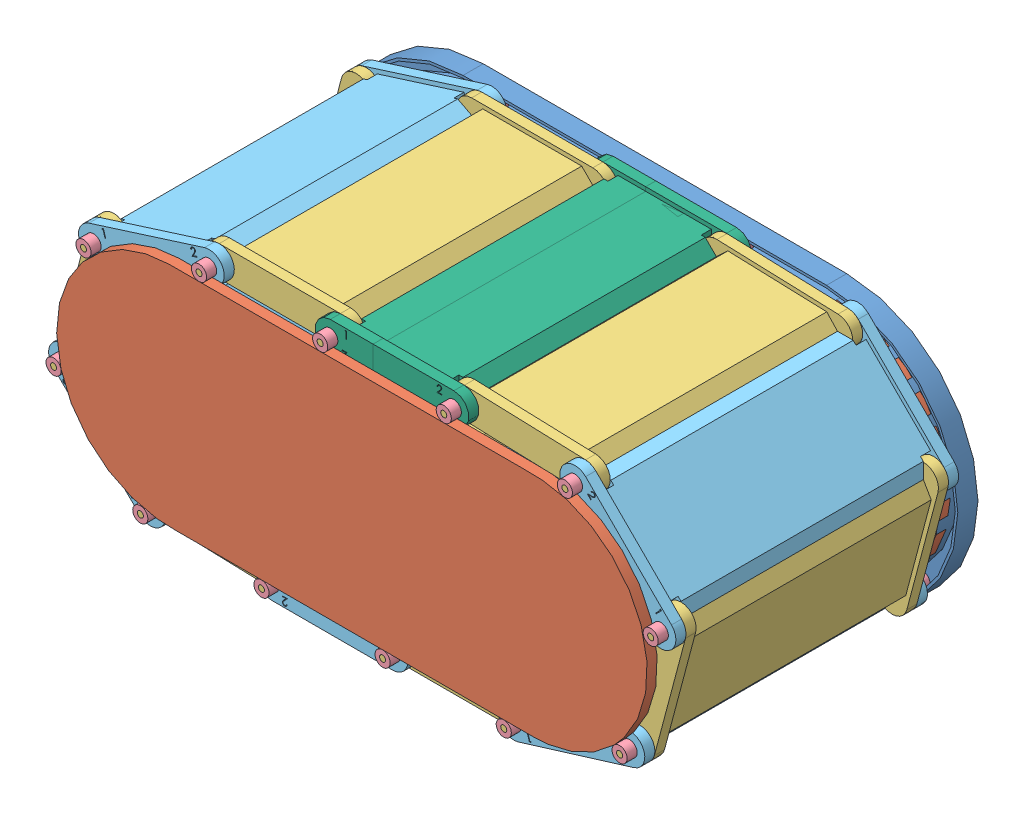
SolidWorks assembly Conveyor_Belt.SLDASM, configuration Default (file format 11000). Lengths in mm.
Overall size (1024.85 352.52 381).
46 component instances, 6 part files, 43 mates.
Components (placement in the parent):
- guide_rail-1: guide_rail.SLDPRT [Default] at (-298.8893 -6.5896 -12.7) size (787.4 330.2 25.4) (hidden)
- conveyor_path-1: conveyor_path.SLDPRT [Surface_Surface_Contact] at (-298.8893 -6.5896 12.7) size (1024.85 285.75 12.7)
- conveyor_path-2: conveyor_path.SLDPRT [Surface_Surface_Contact] at (158.3107 -6.5896 368.3) x (-1 0 0) z (0 0 -1) size (1024.85 285.75 12.7)
- plate-1: plate.sldasm [Default] at (-212.9802 428.2088 190.5) x (-0.999436 0.033586 0) z (0 0 1) size (190.5 38.1 381)
  - plate2-1: plate2.SLDPRT [Default] at (-343.681 273.5692 152.4) size (190.5 38.1 381)
  - wheel-1: wheel.SLDPRT [Default] at (-419.881 273.5692 190.5) size (19.05 19.05 12.7)
  - wheel-2: wheel.SLDPRT [Default] at (-267.481 273.5692 190.5) size (19.05 19.05 12.7)
  - wheel-3: wheel.SLDPRT [Default] at (-419.881 273.5692 -177.8) size (19.05 19.05 12.7)
  - wheel-4: wheel.SLDPRT [Default] at (-267.481 273.5692 -177.8) size (19.05 19.05 12.7)
- plate1-1: plate1.SLDPRT [Default] at (251.4594 86.9125 355.6) x (-0.708444 0.705767 0) z (0 0 1) size (190.5 38.1 355.6)
- plate-2: plate.sldasm [Default] at (638.5638 221.3261 190.5) x (0.25699 0.966414 0) z (0 0 1) size (190.5 38.1 381)
  - plate2-1: plate2.SLDPRT [Default] at (-343.681 273.5692 152.4) size (190.5 38.1 381)
  - wheel-1: wheel.SLDPRT [Default] at (-419.881 273.5692 190.5) size (19.05 19.05 12.7)
  - wheel-2: wheel.SLDPRT [Default] at (-267.481 273.5692 190.5) size (19.05 19.05 12.7)
  - wheel-3: wheel.SLDPRT [Default] at (-419.881 273.5692 -177.8) size (19.05 19.05 12.7)
  - wheel-4: wheel.SLDPRT [Default] at (-267.481 273.5692 -177.8) size (19.05 19.05 12.7)
- plate1-2: plate1.SLDPRT [Default] at (193.4507 -136.569 355.6) x (0.955734 0.294233 0) z (0 0 1) size (190.5 38.1 355.6)
- plate-3: plate.sldasm [Default] at (388.1048 -432.5588 190.5) size (190.5 38.1 381)
  - plate2-1: plate2.SLDPRT [Default] at (-343.681 273.5692 152.4) size (190.5 38.1 381)
  - wheel-1: wheel.SLDPRT [Default] at (-419.881 273.5692 190.5) size (19.05 19.05 12.7)
  - wheel-2: wheel.SLDPRT [Default] at (-267.481 273.5692 190.5) size (19.05 19.05 12.7)
  - wheel-3: wheel.SLDPRT [Default] at (-419.881 273.5692 -177.8) size (19.05 19.05 12.7)
  - wheel-4: wheel.SLDPRT [Default] at (-267.481 273.5692 -177.8) size (19.05 19.05 12.7)
- plate1-3: plate1.SLDPRT [Default] at (-107.9762 -158.9896 355.6) x (-1 0 0) z (0 0 1) size (190.5 38.1 355.6)
- plate-4: plate.sldasm [Default] at (-595.393 127.4382 190.5) x (-0.999521 0.030936 0) z (0 0 1) size (190.5 38.1 381)
  - plate2-1: plate2.SLDPRT [Default] at (-343.681 273.5692 152.4) size (190.5 38.1 381)
  - wheel-1: wheel.SLDPRT [Default] at (-419.881 273.5692 190.5) size (19.05 19.05 12.7)
  - wheel-2: wheel.SLDPRT [Default] at (-267.481 273.5692 190.5) size (19.05 19.05 12.7)
  - wheel-3: wheel.SLDPRT [Default] at (-419.881 273.5692 -177.8) size (19.05 19.05 12.7)
  - wheel-4: wheel.SLDPRT [Default] at (-267.481 273.5692 -177.8) size (19.05 19.05 12.7)
- plate1-4: plate1.SLDPRT [Default] at (-391.0494 -101.0663 355.6) x (-0.715829 0.698276 0) z (0 0 1) size (190.5 38.1 355.6)
- plate-5: plate.sldasm [Default] at (-76.8585 291.514 190.5) x (0.246811 0.969064 0) z (0 0 1) size (190.5 38.1 381)
  - plate2-1: plate2.SLDPRT [Default] at (-343.681 273.5692 152.4) size (190.5 38.1 381)
  - wheel-1: wheel.SLDPRT [Default] at (-419.881 273.5692 190.5) size (19.05 19.05 12.7)
  - wheel-2: wheel.SLDPRT [Default] at (-267.481 273.5692 190.5) size (19.05 19.05 12.7)
  - wheel-3: wheel.SLDPRT [Default] at (-419.881 273.5692 -177.8) size (19.05 19.05 12.7)
  - wheel-4: wheel.SLDPRT [Default] at (-267.481 273.5692 -177.8) size (19.05 19.05 12.7)
- plate1-5: plate1.SLDPRT [Default] at (-335.3329 122.819 355.6) x (0.953395 0.301724 0) z (0 0 1) size (190.5 38.1 355.6)
- plate-6: plate.sldasm [Default] at (-530.1651 419.3796 190.5) x (-1 0 0) z (0 0 1) size (190.5 38.1 381)
  - plate2-1: plate2.SLDPRT [Default] at (-343.681 273.5692 152.4) size (190.5 38.1 381)
  - wheel-1: wheel.SLDPRT [Default] at (-419.881 273.5692 190.5) size (19.05 19.05 12.7)
  - wheel-2: wheel.SLDPRT [Default] at (-267.481 273.5692 190.5) size (19.05 19.05 12.7)
  - wheel-3: wheel.SLDPRT [Default] at (-419.881 273.5692 -177.8) size (19.05 19.05 12.7)
  - wheel-4: wheel.SLDPRT [Default] at (-267.481 273.5692 -177.8) size (19.05 19.05 12.7)
- plate_adjust_p1-1: plate_adjust_p1.SLDPRT [Default] at (-34.0841 145.8104 355.6) size (120.65 38.1 355.6)
- plate_adjust_p1-2: plate_adjust_p1.SLDPRT [Default] at (-31.0381 145.8104 355.6) x (-1 0 0) z (0 0 1) size (120.65 38.1 355.6)
Mates (geometry in assembly coordinates):
- Coincident57: coincident: plane of assembly; plane of assembly; plane of conveyor_path-2 through (-298.8893 -6.5896 381) normal (0 0 1); plane of plate-1/plate2-1 through (45.1619 145.8104 381) normal (0 0 1)
- CamMateTangent20: cam tangent: face of conveyor_path-2; cylinder of plate-1/wheel-2 through (45.1619 145.8104 368.3) axis (0 0 1) radius 9.525
- CamMateTangent21: cam tangent: face of conveyor_path-2; cylinder of plate-1/wheel-1 through (197.4759 140.6919 368.3) axis (0 0 1) radius 9.525
- Concentric48: concentric: cylinder of assembly; point of assembly; cylinder of plate1-1 through (197.4759 140.6919 337.6395) axis (0 0 1) radius 6.35; point of plate-1/wheel-1
- Coincident58: coincident: plane of assembly; plane of assembly; plane of plate-1/plate2-1 through (197.4759 140.6919 355.6) normal (0 0 1); plane of plate1-1 through (305.4428 33.1331 355.6) normal (0 0 -1)
- CamMateTangent22: cam tangent: face of conveyor_path-2; cylinder of plate-2/wheel-2 through (305.4428 33.1331 368.3) axis (0 0 1) radius 9.525
- Concentric49: concentric: cylinder of assembly; point of assembly; cylinder of plate1-1 through (305.4428 33.1331 337.6395) axis (0 0 1) radius 6.35; point of plate-2/wheel-2
- Coincident59: coincident: plane of assembly; plane of assembly; plane of plate1-1 through (305.4428 33.1331 355.6) normal (0 0 -1); plane of plate-2/plate2-1 through (266.2776 -114.1485 355.6) normal (0 0 1)
- Positioning: coincident: line of assembly; line of plate-1/plate2-1 through (59.5932 159.3033 38.1) axis (0 0 1); plane of assembly
- CamMateTangent23: cam tangent: face of conveyor_path-2; cylinder of plate-2/wheel-1 through (266.2776 -114.1485 368.3) axis (0 0 1) radius 9.525
- Concentric51: concentric: cylinder of assembly; point of assembly; cylinder of plate1-2 through (266.2776 -114.1485 337.6395) axis (0 0 1) radius 6.35; point of plate-2/wheel-1
- Coincident63: coincident: plane of assembly; plane of assembly; plane of plate-2/plate2-1 through (266.2776 -114.1485 355.6) normal (0 0 1); plane of plate1-2 through (120.6238 -158.9896 355.6) normal (0 0 -1)
- CamMateTangent24: cam tangent: face of conveyor_path-2; cylinder of plate-3/wheel-2 through (120.6238 -158.9896 368.3) axis (0 0 1) radius 9.525
- CamMateTangent25: cam tangent: face of conveyor_path-2; cylinder of plate-3/wheel-1 through (-31.7762 -158.9896 368.3) axis (0 0 1) radius 9.525
- Concentric52: concentric: cylinder of assembly; point of assembly; cylinder of plate1-2 through (120.6238 -158.9896 337.6395) axis (0 0 1) radius 6.35; point of plate-3/wheel-2
- Coincident64: coincident: plane of assembly; plane of assembly; plane of plate1-2 through (120.6238 -158.9896 355.6) normal (0 0 -1); plane of plate-3/plate2-1 through (-31.7762 -158.9896 355.6) normal (0 0 1)
- Concentric53: concentric: cylinder of assembly; point of assembly; cylinder of plate1-3 through (-31.7762 -158.9896 337.6395) axis (0 0 1) radius 6.35; point of plate-3/wheel-1
- Coincident65: coincident: plane of assembly; plane of assembly; plane of plate-3/plate2-1 through (-31.7762 -158.9896 355.6) normal (0 0 1); plane of plate1-3 through (-31.7762 -158.9896 355.6) normal (0 0 -1)
- CamMateTangent26: cam tangent: face of conveyor_path-2; cylinder of plate-4/wheel-1 through (-184.1762 -158.9896 368.3) axis (0 0 1) radius 9.525
- CamMateTangent27: cam tangent: face of conveyor_path-2; cylinder of plate-4/wheel-2 through (-336.5032 -154.2749 368.3) axis (0 0 1) radius 9.525
- Concentric64: concentric: cylinder of assembly; point of assembly; cylinder of plate1-3 through (-184.1762 -158.9896 337.6395) axis (0 0 1) radius 6.35; point of plate-4/wheel-1
- Coincident66: coincident: plane of assembly; plane of assembly; plane of plate1-3 through (-31.7762 -158.9896 355.6) normal (0 0 -1); plane of plate-4/plate2-1 through (-184.1762 -158.9896 355.6) normal (0 0 1)
- Concentric56: concentric: cylinder of assembly; point of assembly; cylinder of plate1-4 through (-336.5032 -154.2749 337.6395) axis (0 0 1) radius 6.35; point of plate-4/wheel-2
- Coincident67: coincident: plane of assembly; plane of assembly; plane of plate-4/plate2-1 through (-184.1762 -158.9896 355.6) normal (0 0 1); plane of plate1-4 through (-336.5032 -154.2749 355.6) normal (0 0 -1)
- CamMateTangent28: cam tangent: face of conveyor_path-2; cylinder of plate-5/wheel-1 through (-445.5955 -47.8577 368.3) axis (0 0 1) radius 9.525
- CamMateTangent29: cam tangent: face of conveyor_path-2; cylinder of plate-5/wheel-2 through (-407.9816 99.8276 368.3) axis (0 0 1) radius 9.525
- Concentric57: concentric: cylinder of assembly; point of assembly; cylinder of plate1-4 through (-445.5955 -47.8577 337.6395) axis (0 0 1) radius 6.35; point of plate-5/wheel-1
- Coincident68: coincident: plane of assembly; plane of assembly; plane of plate1-4 through (-336.5032 -154.2749 355.6) normal (0 0 -1); plane of plate-5/plate2-1 through (-445.5955 -47.8577 355.6) normal (0 0 1)
- Concentric58: concentric: cylinder of assembly; point of assembly; cylinder of plate1-5 through (-407.9816 99.8276 337.6395) axis (0 0 1) radius 6.35; point of plate-5/wheel-2
- Coincident69: coincident: plane of assembly; plane of assembly; plane of plate-5/plate2-1 through (-445.5955 -47.8577 355.6) normal (0 0 1); plane of plate1-5 through (-407.9816 99.8276 355.6) normal (0 0 -1)
- CamMateTangent32: cam tangent: face of conveyor_path-2; cylinder of plate-6/wheel-2 through (-262.6841 145.8104 368.3) axis (0 0 1) radius 9.525
- CamMateTangent33: cam tangent: face of conveyor_path-2; cylinder of plate-6/wheel-1 through (-110.2841 145.8104 368.3) axis (0 0 1) radius 9.525
- Concentric61: concentric: cylinder of assembly; point of assembly; cylinder of plate1-5 through (-262.6841 145.8104 337.6395) axis (0 0 1) radius 6.35; point of plate-6/wheel-2
- Coincident71: coincident: plane of assembly; plane of assembly; plane of plate1-5 through (-407.9816 99.8276 355.6) normal (0 0 -1); plane of plate-6/plate2-1 through (-110.2841 145.8104 355.6) normal (0 0 1)
- Coincident72: coincident: plane of assembly; plane of assembly; plane of plate-6/plate2-1 through (-110.2841 145.8104 355.6) normal (0 0 1); plane of plate_adjust_p1-1 through (-110.2841 145.8104 355.6) normal (0 0 -1)
- Concentric62: concentric: cylinder of assembly; point of assembly; cylinder of plate_adjust_p1-1 through (-110.2841 145.8104 337.6395) axis (0 0 1) radius 6.35; point of plate-6/wheel-1
- Concentric63: concentric: cylinder of assembly; point of assembly; cylinder of plate_adjust_p1-2 through (45.1619 145.8104 337.6395) axis (0 0 1) radius 6.35; point of plate-1/wheel-2
- Coincident73: coincident: plane of assembly; plane of assembly; plane of plate_adjust_p1-2 through (45.1619 145.8104 355.6) normal (0 0 -1); plane of plate-1/plate2-1 through (197.4759 140.6919 355.6) normal (0 0 1)
- Coincident74: coincident: plane of assembly; plane of assembly; plane of plate_adjust_p1-1 through (-110.2841 159.7804 25.4) normal (0 1 0); plane of plate_adjust_p1-2 through (45.1619 159.7804 25.4) normal (0 1 0)
- PathMate1: path: unknown of ?
- PathMate2: path: unknown of ?
- Lock1: lock: unknown of plate_adjust_p1-1; unknown of plate_adjust_p1-2
- PathMate3: path: point of plate-4/wheel-1; curve of assembly
